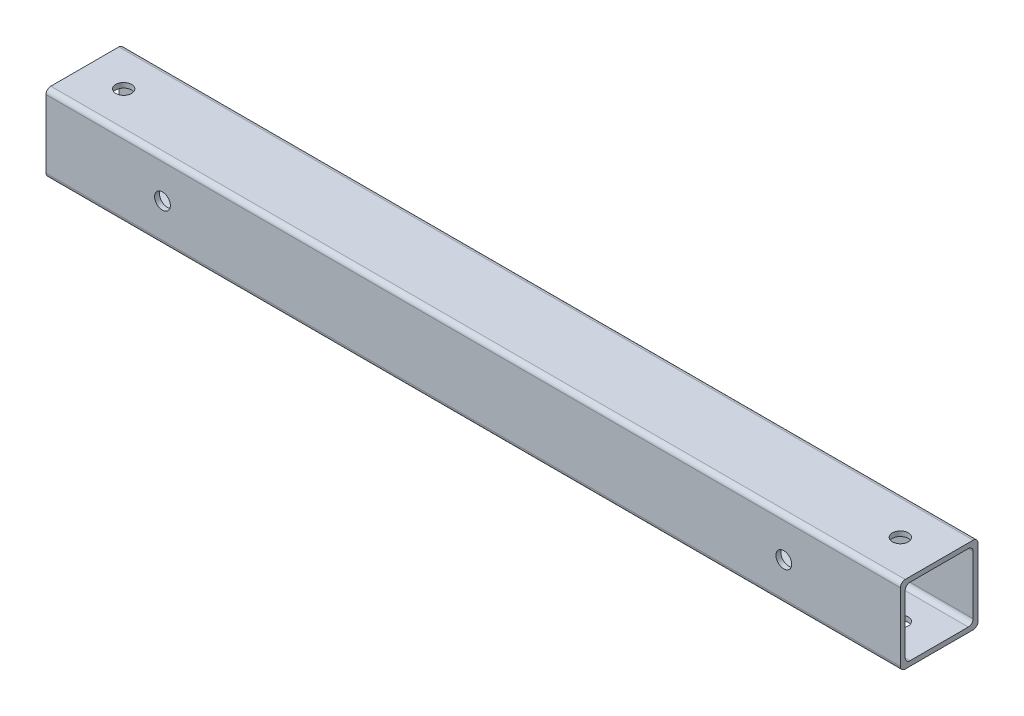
ISO-10303-21;
HEADER;
FILE_DESCRIPTION(('STEP AP214'),'2;1');
FILE_NAME('part.step','',(''),(''),'','','');
FILE_SCHEMA(('AUTOMOTIVE_DESIGN { 1 0 10303 214 1 1 1 1 }'));
ENDSEC;
DATA;
#1=APPLICATION_CONTEXT('core data for automotive mechanical design processes');
#2=APPLICATION_PROTOCOL_DEFINITION('international standard','automotive_design',2000,#1);
#3=PRODUCT_CONTEXT('',#1,'mechanical');
#4=PRODUCT('Part','Part','',(#3));
#5=PRODUCT_RELATED_PRODUCT_CATEGORY('part','',(#4));
#6=PRODUCT_DEFINITION_FORMATION('','',#4);
#7=PRODUCT_DEFINITION_CONTEXT('part definition',#1,'design');
#8=PRODUCT_DEFINITION('design','',#6,#7);
#9=PRODUCT_DEFINITION_SHAPE('','',#8);
#10=(LENGTH_UNIT() NAMED_UNIT(*) SI_UNIT(.MILLI.,.METRE.));
#11=(NAMED_UNIT(*) PLANE_ANGLE_UNIT() SI_UNIT($,.RADIAN.));
#12=(NAMED_UNIT(*) SI_UNIT($,.STERADIAN.) SOLID_ANGLE_UNIT());
#13=UNCERTAINTY_MEASURE_WITH_UNIT(LENGTH_MEASURE(1.E-05),#10,'distance_accuracy_value','');
#14=(GEOMETRIC_REPRESENTATION_CONTEXT(3) GLOBAL_UNCERTAINTY_ASSIGNED_CONTEXT((#13)) GLOBAL_UNIT_ASSIGNED_CONTEXT((#10,
#11,#12)) REPRESENTATION_CONTEXT('',''));
#15=CARTESIAN_POINT('',(0.,0.,0.));
#16=DIRECTION('',(0.,0.,1.));
#17=DIRECTION('',(1.,0.,0.));
#18=AXIS2_PLACEMENT_3D('',#15,#16,#17);
#19=CARTESIAN_POINT('',(0.,101.6,0.));
#20=DIRECTION('',(0.,0.,1.));
#21=DIRECTION('',(1.,0.,0.));
#22=AXIS2_PLACEMENT_3D('',#19,#20,#21);
#23=PLANE('',#22);
#24=DIRECTION('',(0.,-1.,0.));
#25=VECTOR('',#24,1.);
#26=CARTESIAN_POINT('',(-1117.6,101.6,1.36862006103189E-13));
#27=LINE('',#26,#25);
#28=CARTESIAN_POINT('',(-1117.6,95.25,1.36862006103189E-13));
#29=VERTEX_POINT('',#28);
#30=CARTESIAN_POINT('',(-1117.6,6.34999999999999,1.36862006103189E-13));
#31=VERTEX_POINT('',#30);
#32=EDGE_CURVE('E264',#29,#31,#27,.T.);
#33=ORIENTED_EDGE('',*,*,#32,.F.);
#34=DIRECTION('',(-1.,0.,0.));
#35=VECTOR('',#34,1.);
#36=CARTESIAN_POINT('',(0.,95.25,0.));
#37=LINE('',#36,#35);
#38=CARTESIAN_POINT('',(0.,95.25,0.));
#39=VERTEX_POINT('',#38);
#40=EDGE_CURVE('E313',#29,#39,#37,.F.);
#41=ORIENTED_EDGE('',*,*,#40,.T.);
#42=DIRECTION('',(0.,-1.,0.));
#43=VECTOR('',#42,1.);
#44=CARTESIAN_POINT('',(0.,101.6,0.));
#45=LINE('',#44,#43);
#46=CARTESIAN_POINT('',(0.,6.34999999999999,0.));
#47=VERTEX_POINT('',#46);
#48=EDGE_CURVE('E160',#39,#47,#45,.T.);
#49=ORIENTED_EDGE('',*,*,#48,.T.);
#50=DIRECTION('',(-1.,0.,0.));
#51=VECTOR('',#50,1.);
#52=CARTESIAN_POINT('',(-1117.6,6.34999999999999,1.36862006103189E-13));
#53=LINE('',#52,#51);
#54=EDGE_CURVE('E311',#47,#31,#53,.T.);
#55=ORIENTED_EDGE('',*,*,#54,.T.);
#56=EDGE_LOOP('',(#33,#41,#49,#55));
#57=FACE_BOUND('',#56,.T.);
#58=CARTESIAN_POINT('',(-965.2,50.8,0.));
#59=DIRECTION('',(0.,0.,1.));
#60=DIRECTION('',(1.,0.,0.));
#61=AXIS2_PLACEMENT_3D('',#58,#59,#60);
#62=CIRCLE('',#61,10.31875);
#63=CARTESIAN_POINT('',(-954.88125,50.8,0.));
#64=VERTEX_POINT('',#63);
#65=EDGE_CURVE('E195',#64,#64,#62,.T.);
#66=ORIENTED_EDGE('',*,*,#65,.T.);
#67=EDGE_LOOP('',(#66));
#68=FACE_BOUND('',#67,.T.);
#69=CARTESIAN_POINT('',(-152.4,50.8,0.));
#70=DIRECTION('',(0.,0.,-1.));
#71=DIRECTION('',(-1.,0.,0.));
#72=AXIS2_PLACEMENT_3D('',#69,#70,#71);
#73=CIRCLE('',#72,10.31875);
#74=CARTESIAN_POINT('',(-162.71875,50.8,0.));
#75=VERTEX_POINT('',#74);
#76=EDGE_CURVE('E415',#75,#75,#73,.T.);
#77=ORIENTED_EDGE('',*,*,#76,.F.);
#78=EDGE_LOOP('',(#77));
#79=FACE_BOUND('',#78,.T.);
#80=ADVANCED_FACE('F31',(#57,#68,#79),#23,.F.);
#81=CARTESIAN_POINT('',(0.,101.6,101.6));
#82=DIRECTION('',(0.,0.,-1.));
#83=DIRECTION('',(-1.,0.,0.));
#84=AXIS2_PLACEMENT_3D('',#81,#82,#83);
#85=PLANE('',#84);
#86=DIRECTION('',(0.,-1.,0.));
#87=VECTOR('',#86,1.);
#88=CARTESIAN_POINT('',(-1117.6,101.6,101.6));
#89=LINE('',#88,#87);
#90=CARTESIAN_POINT('',(-1117.6,95.25,101.6));
#91=VERTEX_POINT('',#90);
#92=CARTESIAN_POINT('',(-1117.6,6.34999999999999,101.6));
#93=VERTEX_POINT('',#92);
#94=EDGE_CURVE('E261',#91,#93,#89,.T.);
#95=ORIENTED_EDGE('',*,*,#94,.T.);
#96=DIRECTION('',(1.,0.,0.));
#97=VECTOR('',#96,1.);
#98=CARTESIAN_POINT('',(0.,6.34999999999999,101.6));
#99=LINE('',#98,#97);
#100=CARTESIAN_POINT('',(0.,6.34999999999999,101.6));
#101=VERTEX_POINT('',#100);
#102=EDGE_CURVE('E276',#93,#101,#99,.T.);
#103=ORIENTED_EDGE('',*,*,#102,.T.);
#104=DIRECTION('',(0.,-1.,0.));
#105=VECTOR('',#104,1.);
#106=CARTESIAN_POINT('',(0.,101.6,101.6));
#107=LINE('',#106,#105);
#108=CARTESIAN_POINT('',(0.,95.25,101.6));
#109=VERTEX_POINT('',#108);
#110=EDGE_CURVE('E254',#109,#101,#107,.T.);
#111=ORIENTED_EDGE('',*,*,#110,.F.);
#112=DIRECTION('',(1.,0.,0.));
#113=VECTOR('',#112,1.);
#114=CARTESIAN_POINT('',(0.,95.25,101.6));
#115=LINE('',#114,#113);
#116=EDGE_CURVE('E274',#109,#91,#115,.F.);
#117=ORIENTED_EDGE('',*,*,#116,.T.);
#118=EDGE_LOOP('',(#95,#103,#111,#117));
#119=FACE_BOUND('',#118,.T.);
#120=CARTESIAN_POINT('',(-965.2,50.8,101.6));
#121=DIRECTION('',(0.,0.,1.));
#122=DIRECTION('',(1.,0.,0.));
#123=AXIS2_PLACEMENT_3D('',#120,#121,#122);
#124=CIRCLE('',#123,10.31875);
#125=CARTESIAN_POINT('',(-954.88125,50.8,101.6));
#126=VERTEX_POINT('',#125);
#127=EDGE_CURVE('E203',#126,#126,#124,.T.);
#128=ORIENTED_EDGE('',*,*,#127,.F.);
#129=EDGE_LOOP('',(#128));
#130=FACE_BOUND('',#129,.T.);
#131=CARTESIAN_POINT('',(-152.4,50.8,101.6));
#132=DIRECTION('',(0.,0.,-1.));
#133=DIRECTION('',(-1.,0.,0.));
#134=AXIS2_PLACEMENT_3D('',#131,#132,#133);
#135=CIRCLE('',#134,10.31875);
#136=CARTESIAN_POINT('',(-162.71875,50.8,101.6));
#137=VERTEX_POINT('',#136);
#138=EDGE_CURVE('E422',#137,#137,#135,.T.);
#139=ORIENTED_EDGE('',*,*,#138,.T.);
#140=EDGE_LOOP('',(#139));
#141=FACE_BOUND('',#140,.T.);
#142=ADVANCED_FACE('F339',(#119,#130,#141),#85,.F.);
#143=CARTESIAN_POINT('',(0.000999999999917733,95.25,6.35000000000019));
#144=DIRECTION('',(0.,0.,-1.));
#145=DIRECTION('',(0.,1.,0.));
#146=AXIS2_PLACEMENT_3D('',#143,#144,#145);
#147=PLANE('',#146);
#148=DIRECTION('',(0.,1.,0.));
#149=VECTOR('',#148,1.);
#150=CARTESIAN_POINT('',(0.,95.25,6.35000000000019));
#151=LINE('',#150,#149);
#152=CARTESIAN_POINT('',(0.,12.7,6.3500000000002));
#153=VERTEX_POINT('',#152);
#154=CARTESIAN_POINT('',(0.,88.9,6.35000000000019));
#155=VERTEX_POINT('',#154);
#156=EDGE_CURVE('E230',#153,#155,#151,.T.);
#157=ORIENTED_EDGE('',*,*,#156,.T.);
#158=DIRECTION('',(-1.,0.,0.));
#159=VECTOR('',#158,1.);
#160=CARTESIAN_POINT('',(-1117.6,88.9,6.35000000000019));
#161=LINE('',#160,#159);
#162=CARTESIAN_POINT('',(-1117.6,88.9,6.35000000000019));
#163=VERTEX_POINT('',#162);
#164=EDGE_CURVE('E308',#155,#163,#161,.T.);
#165=ORIENTED_EDGE('',*,*,#164,.T.);
#166=DIRECTION('',(0.,-1.,0.));
#167=VECTOR('',#166,1.);
#168=CARTESIAN_POINT('',(-1117.6,95.25,6.35000000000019));
#169=LINE('',#168,#167);
#170=CARTESIAN_POINT('',(-1117.6,12.7,6.3500000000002));
#171=VERTEX_POINT('',#170);
#172=EDGE_CURVE('E233',#163,#171,#169,.T.);
#173=ORIENTED_EDGE('',*,*,#172,.T.);
#174=DIRECTION('',(-1.,0.,0.));
#175=VECTOR('',#174,1.);
#176=CARTESIAN_POINT('',(0.,12.7,6.3500000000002));
#177=LINE('',#176,#175);
#178=EDGE_CURVE('E306',#171,#153,#177,.F.);
#179=ORIENTED_EDGE('',*,*,#178,.T.);
#180=EDGE_LOOP('',(#157,#165,#173,#179));
#181=FACE_BOUND('',#180,.T.);
#182=CARTESIAN_POINT('',(-965.2,50.8,6.3500000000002));
#183=DIRECTION('',(0.,0.,-1.));
#184=DIRECTION('',(0.,1.,0.));
#185=AXIS2_PLACEMENT_3D('',#182,#183,#184);
#186=CIRCLE('',#185,10.31875);
#187=CARTESIAN_POINT('',(-965.2,61.11875,6.3500000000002));
#188=VERTEX_POINT('',#187);
#189=EDGE_CURVE('E194',#188,#188,#186,.T.);
#190=ORIENTED_EDGE('',*,*,#189,.T.);
#191=EDGE_LOOP('',(#190));
#192=FACE_BOUND('',#191,.T.);
#193=CARTESIAN_POINT('',(-152.4,50.8,6.3500000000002));
#194=DIRECTION('',(0.,0.,-1.));
#195=DIRECTION('',(0.,1.,0.));
#196=AXIS2_PLACEMENT_3D('',#193,#194,#195);
#197=CIRCLE('',#196,10.31875);
#198=CARTESIAN_POINT('',(-152.4,61.11875,6.3500000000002));
#199=VERTEX_POINT('',#198);
#200=EDGE_CURVE('E211',#199,#199,#197,.F.);
#201=ORIENTED_EDGE('',*,*,#200,.F.);
#202=EDGE_LOOP('',(#201));
#203=FACE_BOUND('',#202,.T.);
#204=ADVANCED_FACE('F345',(#181,#192,#203),#147,.F.);
#205=CARTESIAN_POINT('',(0.000999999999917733,95.25,95.2500000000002));
#206=DIRECTION('',(0.,0.,1.));
#207=DIRECTION('',(0.,-1.,0.));
#208=AXIS2_PLACEMENT_3D('',#205,#206,#207);
#209=PLANE('',#208);
#210=DIRECTION('',(0.,-1.,0.));
#211=VECTOR('',#210,1.);
#212=CARTESIAN_POINT('',(0.,95.25,95.2500000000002));
#213=LINE('',#212,#211);
#214=CARTESIAN_POINT('',(0.,88.9,95.2500000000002));
#215=VERTEX_POINT('',#214);
#216=CARTESIAN_POINT('',(0.,12.7,95.2500000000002));
#217=VERTEX_POINT('',#216);
#218=EDGE_CURVE('E153',#215,#217,#213,.T.);
#219=ORIENTED_EDGE('',*,*,#218,.T.);
#220=DIRECTION('',(-1.,0.,0.));
#221=VECTOR('',#220,1.);
#222=CARTESIAN_POINT('',(-1117.6,12.7,95.2500000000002));
#223=LINE('',#222,#221);
#224=CARTESIAN_POINT('',(-1117.6,12.7,95.2500000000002));
#225=VERTEX_POINT('',#224);
#226=EDGE_CURVE('E159',#217,#225,#223,.T.);
#227=ORIENTED_EDGE('',*,*,#226,.T.);
#228=DIRECTION('',(0.,1.,0.));
#229=VECTOR('',#228,1.);
#230=CARTESIAN_POINT('',(-1117.6,95.25,95.2500000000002));
#231=LINE('',#230,#229);
#232=CARTESIAN_POINT('',(-1117.6,88.9,95.2500000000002));
#233=VERTEX_POINT('',#232);
#234=EDGE_CURVE('E156',#225,#233,#231,.T.);
#235=ORIENTED_EDGE('',*,*,#234,.T.);
#236=DIRECTION('',(-1.,0.,0.));
#237=VECTOR('',#236,1.);
#238=CARTESIAN_POINT('',(0.,88.9,95.2500000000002));
#239=LINE('',#238,#237);
#240=EDGE_CURVE('E148',#233,#215,#239,.F.);
#241=ORIENTED_EDGE('',*,*,#240,.T.);
#242=EDGE_LOOP('',(#219,#227,#235,#241));
#243=FACE_BOUND('',#242,.T.);
#244=CARTESIAN_POINT('',(-965.2,50.8,95.2500000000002));
#245=DIRECTION('',(0.,0.,1.));
#246=DIRECTION('',(0.,-1.,0.));
#247=AXIS2_PLACEMENT_3D('',#244,#245,#246);
#248=CIRCLE('',#247,10.31875);
#249=CARTESIAN_POINT('',(-965.2,40.48125,95.2500000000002));
#250=VERTEX_POINT('',#249);
#251=EDGE_CURVE('E192',#250,#250,#248,.T.);
#252=ORIENTED_EDGE('',*,*,#251,.T.);
#253=EDGE_LOOP('',(#252));
#254=FACE_BOUND('',#253,.T.);
#255=CARTESIAN_POINT('',(-152.4,50.8,95.2500000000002));
#256=DIRECTION('',(0.,0.,1.));
#257=DIRECTION('',(0.,-1.,0.));
#258=AXIS2_PLACEMENT_3D('',#255,#256,#257);
#259=CIRCLE('',#258,10.31875);
#260=CARTESIAN_POINT('',(-152.4,40.48125,95.2500000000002));
#261=VERTEX_POINT('',#260);
#262=EDGE_CURVE('E35',#261,#261,#259,.F.);
#263=ORIENTED_EDGE('',*,*,#262,.F.);
#264=EDGE_LOOP('',(#263));
#265=FACE_BOUND('',#264,.T.);
#266=ADVANCED_FACE('F150',(#243,#254,#265),#209,.F.);
#267=CARTESIAN_POINT('',(0.,101.6,0.));
#268=DIRECTION('',(0.,-1.,0.));
#269=DIRECTION('',(0.,0.,-1.));
#270=AXIS2_PLACEMENT_3D('',#267,#268,#269);
#271=PLANE('',#270);
#272=DIRECTION('',(0.,0.,1.));
#273=VECTOR('',#272,1.);
#274=CARTESIAN_POINT('',(-1117.6,101.6,1.36862006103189E-13));
#275=LINE('',#274,#273);
#276=CARTESIAN_POINT('',(-1117.6,101.6,6.35000000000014));
#277=VERTEX_POINT('',#276);
#278=CARTESIAN_POINT('',(-1117.6,101.6,95.2500000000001));
#279=VERTEX_POINT('',#278);
#280=EDGE_CURVE('E250',#277,#279,#275,.T.);
#281=ORIENTED_EDGE('',*,*,#280,.T.);
#282=DIRECTION('',(1.,0.,0.));
#283=VECTOR('',#282,1.);
#284=CARTESIAN_POINT('',(0.,101.6,95.25));
#285=LINE('',#284,#283);
#286=CARTESIAN_POINT('',(0.,101.6,95.25));
#287=VERTEX_POINT('',#286);
#288=EDGE_CURVE('E300',#279,#287,#285,.T.);
#289=ORIENTED_EDGE('',*,*,#288,.T.);
#290=DIRECTION('',(0.,0.,-1.));
#291=VECTOR('',#290,1.);
#292=CARTESIAN_POINT('',(0.,101.6,0.));
#293=LINE('',#292,#291);
#294=CARTESIAN_POINT('',(0.,101.6,6.35));
#295=VERTEX_POINT('',#294);
#296=EDGE_CURVE('E247',#287,#295,#293,.T.);
#297=ORIENTED_EDGE('',*,*,#296,.T.);
#298=DIRECTION('',(-1.,0.,0.));
#299=VECTOR('',#298,1.);
#300=CARTESIAN_POINT('',(0.,101.6,6.35));
#301=LINE('',#300,#299);
#302=EDGE_CURVE('E297',#295,#277,#301,.T.);
#303=ORIENTED_EDGE('',*,*,#302,.T.);
#304=EDGE_LOOP('',(#281,#289,#297,#303));
#305=FACE_BOUND('',#304,.T.);
#306=CARTESIAN_POINT('',(-1066.8,101.6,50.8000000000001));
#307=DIRECTION('',(0.,1.,0.));
#308=DIRECTION('',(0.,0.,1.));
#309=AXIS2_PLACEMENT_3D('',#306,#307,#308);
#310=CIRCLE('',#309,10.31875);
#311=CARTESIAN_POINT('',(-1066.8,101.6,61.1187500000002));
#312=VERTEX_POINT('',#311);
#313=EDGE_CURVE('E222',#312,#312,#310,.T.);
#314=ORIENTED_EDGE('',*,*,#313,.F.);
#315=EDGE_LOOP('',(#314));
#316=FACE_BOUND('',#315,.T.);
#317=CARTESIAN_POINT('',(-50.8000000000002,101.6,50.8000000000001));
#318=DIRECTION('',(0.,-1.,0.));
#319=DIRECTION('',(0.,0.,1.));
#320=AXIS2_PLACEMENT_3D('',#317,#318,#319);
#321=CIRCLE('',#320,10.31875);
#322=CARTESIAN_POINT('',(-50.8000000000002,101.6,61.1187500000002));
#323=VERTEX_POINT('',#322);
#324=EDGE_CURVE('E206',#323,#323,#321,.T.);
#325=ORIENTED_EDGE('',*,*,#324,.T.);
#326=EDGE_LOOP('',(#325));
#327=FACE_BOUND('',#326,.T.);
#328=ADVANCED_FACE('F366',(#305,#316,#327),#271,.F.);
#329=CARTESIAN_POINT('',(0.,0.,0.));
#330=DIRECTION('',(0.,-1.,0.));
#331=DIRECTION('',(0.,0.,-1.));
#332=AXIS2_PLACEMENT_3D('',#329,#330,#331);
#333=PLANE('',#332);
#334=DIRECTION('',(0.,0.,-1.));
#335=VECTOR('',#334,1.);
#336=CARTESIAN_POINT('',(0.,0.,0.));
#337=LINE('',#336,#335);
#338=CARTESIAN_POINT('',(0.,0.,95.25));
#339=VERTEX_POINT('',#338);
#340=CARTESIAN_POINT('',(0.,0.,6.35));
#341=VERTEX_POINT('',#340);
#342=EDGE_CURVE('E246',#339,#341,#337,.T.);
#343=ORIENTED_EDGE('',*,*,#342,.F.);
#344=DIRECTION('',(1.,0.,0.));
#345=VECTOR('',#344,1.);
#346=CARTESIAN_POINT('',(-1117.6,0.,95.2500000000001));
#347=LINE('',#346,#345);
#348=CARTESIAN_POINT('',(-1117.6,0.,95.2500000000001));
#349=VERTEX_POINT('',#348);
#350=EDGE_CURVE('E289',#339,#349,#347,.F.);
#351=ORIENTED_EDGE('',*,*,#350,.T.);
#352=DIRECTION('',(0.,0.,1.));
#353=VECTOR('',#352,1.);
#354=CARTESIAN_POINT('',(-1117.6,0.,1.36862006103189E-13));
#355=LINE('',#354,#353);
#356=CARTESIAN_POINT('',(-1117.6,0.,6.35000000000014));
#357=VERTEX_POINT('',#356);
#358=EDGE_CURVE('E251',#357,#349,#355,.T.);
#359=ORIENTED_EDGE('',*,*,#358,.F.);
#360=DIRECTION('',(-1.,0.,0.));
#361=VECTOR('',#360,1.);
#362=CARTESIAN_POINT('',(0.,0.,6.35));
#363=LINE('',#362,#361);
#364=EDGE_CURVE('E287',#357,#341,#363,.F.);
#365=ORIENTED_EDGE('',*,*,#364,.T.);
#366=EDGE_LOOP('',(#343,#351,#359,#365));
#367=FACE_BOUND('',#366,.T.);
#368=CARTESIAN_POINT('',(-1066.8,0.,50.8000000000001));
#369=DIRECTION('',(0.,1.,0.));
#370=DIRECTION('',(0.,0.,1.));
#371=AXIS2_PLACEMENT_3D('',#368,#369,#370);
#372=CIRCLE('',#371,10.31875);
#373=CARTESIAN_POINT('',(-1066.8,0.,61.1187500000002));
#374=VERTEX_POINT('',#373);
#375=EDGE_CURVE('E191',#374,#374,#372,.T.);
#376=ORIENTED_EDGE('',*,*,#375,.T.);
#377=EDGE_LOOP('',(#376));
#378=FACE_BOUND('',#377,.T.);
#379=CARTESIAN_POINT('',(-50.8000000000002,0.,50.8000000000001));
#380=DIRECTION('',(0.,-1.,0.));
#381=DIRECTION('',(0.,0.,1.));
#382=AXIS2_PLACEMENT_3D('',#379,#380,#381);
#383=CIRCLE('',#382,10.31875);
#384=CARTESIAN_POINT('',(-50.8000000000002,0.,61.1187500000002));
#385=VERTEX_POINT('',#384);
#386=EDGE_CURVE('E199',#385,#385,#383,.T.);
#387=ORIENTED_EDGE('',*,*,#386,.F.);
#388=EDGE_LOOP('',(#387));
#389=FACE_BOUND('',#388,.T.);
#390=ADVANCED_FACE('F358',(#367,#378,#389),#333,.T.);
#391=CARTESIAN_POINT('',(0.000999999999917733,95.25,6.35000000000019));
#392=DIRECTION('',(0.,1.,0.));
#393=DIRECTION('',(0.,0.,1.));
#394=AXIS2_PLACEMENT_3D('',#391,#392,#393);
#395=PLANE('',#394);
#396=DIRECTION('',(0.,0.,1.));
#397=VECTOR('',#396,1.);
#398=CARTESIAN_POINT('',(0.,95.25,6.35000000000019));
#399=LINE('',#398,#397);
#400=CARTESIAN_POINT('',(0.,95.25,12.7000000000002));
#401=VERTEX_POINT('',#400);
#402=CARTESIAN_POINT('',(0.,95.25,88.9000000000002));
#403=VERTEX_POINT('',#402);
#404=EDGE_CURVE('E171',#401,#403,#399,.T.);
#405=ORIENTED_EDGE('',*,*,#404,.T.);
#406=DIRECTION('',(-1.,0.,0.));
#407=VECTOR('',#406,1.);
#408=CARTESIAN_POINT('',(-1117.6,95.25,88.9000000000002));
#409=LINE('',#408,#407);
#410=CARTESIAN_POINT('',(-1117.6,95.25,88.9000000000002));
#411=VERTEX_POINT('',#410);
#412=EDGE_CURVE('E177',#403,#411,#409,.T.);
#413=ORIENTED_EDGE('',*,*,#412,.T.);
#414=DIRECTION('',(0.,0.,-1.));
#415=VECTOR('',#414,1.);
#416=CARTESIAN_POINT('',(-1117.6,95.25,6.35000000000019));
#417=LINE('',#416,#415);
#418=CARTESIAN_POINT('',(-1117.6,95.25,12.7000000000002));
#419=VERTEX_POINT('',#418);
#420=EDGE_CURVE('E240',#411,#419,#417,.T.);
#421=ORIENTED_EDGE('',*,*,#420,.T.);
#422=DIRECTION('',(-1.,0.,0.));
#423=VECTOR('',#422,1.);
#424=CARTESIAN_POINT('',(0.,95.25,12.7000000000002));
#425=LINE('',#424,#423);
#426=EDGE_CURVE('E303',#419,#401,#425,.F.);
#427=ORIENTED_EDGE('',*,*,#426,.T.);
#428=EDGE_LOOP('',(#405,#413,#421,#427));
#429=FACE_BOUND('',#428,.T.);
#430=CARTESIAN_POINT('',(-1066.8,95.25,50.8000000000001));
#431=DIRECTION('',(0.,1.,0.));
#432=DIRECTION('',(0.,0.,1.));
#433=AXIS2_PLACEMENT_3D('',#430,#431,#432);
#434=CIRCLE('',#433,10.31875);
#435=CARTESIAN_POINT('',(-1066.8,95.25,61.1187500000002));
#436=VERTEX_POINT('',#435);
#437=EDGE_CURVE('E172',#436,#436,#434,.T.);
#438=ORIENTED_EDGE('',*,*,#437,.T.);
#439=EDGE_LOOP('',(#438));
#440=FACE_BOUND('',#439,.T.);
#441=CARTESIAN_POINT('',(-50.8000000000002,95.25,50.8000000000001));
#442=DIRECTION('',(0.,1.,0.));
#443=DIRECTION('',(0.,0.,1.));
#444=AXIS2_PLACEMENT_3D('',#441,#442,#443);
#445=CIRCLE('',#444,10.31875);
#446=CARTESIAN_POINT('',(-50.8000000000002,95.25,61.1187500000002));
#447=VERTEX_POINT('',#446);
#448=EDGE_CURVE('E198',#447,#447,#445,.F.);
#449=ORIENTED_EDGE('',*,*,#448,.F.);
#450=EDGE_LOOP('',(#449));
#451=FACE_BOUND('',#450,.T.);
#452=ADVANCED_FACE('F353',(#429,#440,#451),#395,.F.);
#453=CARTESIAN_POINT('',(0.000999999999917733,6.35,6.35000000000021));
#454=DIRECTION('',(0.,-1.,0.));
#455=DIRECTION('',(0.,0.,-1.));
#456=AXIS2_PLACEMENT_3D('',#453,#454,#455);
#457=PLANE('',#456);
#458=DIRECTION('',(0.,0.,1.));
#459=VECTOR('',#458,1.);
#460=CARTESIAN_POINT('',(-1117.6,6.35,6.35000000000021));
#461=LINE('',#460,#459);
#462=CARTESIAN_POINT('',(-1117.6,6.35,12.7000000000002));
#463=VERTEX_POINT('',#462);
#464=CARTESIAN_POINT('',(-1117.6,6.35,88.9000000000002));
#465=VERTEX_POINT('',#464);
#466=EDGE_CURVE('E236',#463,#465,#461,.T.);
#467=ORIENTED_EDGE('',*,*,#466,.T.);
#468=DIRECTION('',(-1.,0.,0.));
#469=VECTOR('',#468,1.);
#470=CARTESIAN_POINT('',(0.,6.35,88.9000000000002));
#471=LINE('',#470,#469);
#472=CARTESIAN_POINT('',(0.,6.35,88.9000000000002));
#473=VERTEX_POINT('',#472);
#474=EDGE_CURVE('E272',#465,#473,#471,.F.);
#475=ORIENTED_EDGE('',*,*,#474,.T.);
#476=DIRECTION('',(0.,0.,-1.));
#477=VECTOR('',#476,1.);
#478=CARTESIAN_POINT('',(0.,6.35,6.35000000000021));
#479=LINE('',#478,#477);
#480=CARTESIAN_POINT('',(0.,6.35,12.7000000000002));
#481=VERTEX_POINT('',#480);
#482=EDGE_CURVE('E243',#473,#481,#479,.T.);
#483=ORIENTED_EDGE('',*,*,#482,.T.);
#484=DIRECTION('',(-1.,0.,0.));
#485=VECTOR('',#484,1.);
#486=CARTESIAN_POINT('',(-1117.6,6.35,12.7000000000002));
#487=LINE('',#486,#485);
#488=EDGE_CURVE('E269',#481,#463,#487,.T.);
#489=ORIENTED_EDGE('',*,*,#488,.T.);
#490=EDGE_LOOP('',(#467,#475,#483,#489));
#491=FACE_BOUND('',#490,.T.);
#492=CARTESIAN_POINT('',(-1066.8,6.35,50.8000000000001));
#493=DIRECTION('',(0.,-1.,0.));
#494=DIRECTION('',(0.,0.,-1.));
#495=AXIS2_PLACEMENT_3D('',#492,#493,#494);
#496=CIRCLE('',#495,10.31875);
#497=CARTESIAN_POINT('',(-1066.8,6.35,40.4812500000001));
#498=VERTEX_POINT('',#497);
#499=EDGE_CURVE('E188',#498,#498,#496,.T.);
#500=ORIENTED_EDGE('',*,*,#499,.T.);
#501=EDGE_LOOP('',(#500));
#502=FACE_BOUND('',#501,.T.);
#503=CARTESIAN_POINT('',(-50.8000000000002,6.35,50.8000000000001));
#504=DIRECTION('',(0.,-1.,0.));
#505=DIRECTION('',(0.,0.,-1.));
#506=AXIS2_PLACEMENT_3D('',#503,#504,#505);
#507=CIRCLE('',#506,10.31875);
#508=CARTESIAN_POINT('',(-50.8000000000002,6.35,40.4812500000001));
#509=VERTEX_POINT('',#508);
#510=EDGE_CURVE('E196',#509,#509,#507,.F.);
#511=ORIENTED_EDGE('',*,*,#510,.F.);
#512=EDGE_LOOP('',(#511));
#513=FACE_BOUND('',#512,.T.);
#514=ADVANCED_FACE('F322',(#491,#502,#513),#457,.F.);
#515=CARTESIAN_POINT('',(0.,101.6,0.));
#516=DIRECTION('',(-1.,0.,0.));
#517=DIRECTION('',(0.,0.,1.));
#518=AXIS2_PLACEMENT_3D('',#515,#516,#517);
#519=PLANE('',#518);
#520=ORIENTED_EDGE('',*,*,#404,.F.);
#521=CARTESIAN_POINT('',(0.,88.9,12.7000000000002));
#522=DIRECTION('',(-1.,0.,0.));
#523=DIRECTION('',(0.,0.,1.));
#524=AXIS2_PLACEMENT_3D('',#521,#522,#523);
#525=CIRCLE('',#524,6.35);
#526=EDGE_CURVE('E181',#401,#155,#525,.T.);
#527=ORIENTED_EDGE('',*,*,#526,.T.);
#528=ORIENTED_EDGE('',*,*,#156,.F.);
#529=CARTESIAN_POINT('',(0.,12.7,12.7000000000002));
#530=DIRECTION('',(-1.,0.,0.));
#531=DIRECTION('',(0.,0.,1.));
#532=AXIS2_PLACEMENT_3D('',#529,#530,#531);
#533=CIRCLE('',#532,6.35);
#534=EDGE_CURVE('E11',#153,#481,#533,.T.);
#535=ORIENTED_EDGE('',*,*,#534,.T.);
#536=ORIENTED_EDGE('',*,*,#482,.F.);
#537=CARTESIAN_POINT('',(0.,12.7,88.9000000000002));
#538=DIRECTION('',(-1.,0.,0.));
#539=DIRECTION('',(0.,0.,1.));
#540=AXIS2_PLACEMENT_3D('',#537,#538,#539);
#541=CIRCLE('',#540,6.35);
#542=EDGE_CURVE('E170',#473,#217,#541,.T.);
#543=ORIENTED_EDGE('',*,*,#542,.T.);
#544=ORIENTED_EDGE('',*,*,#218,.F.);
#545=CARTESIAN_POINT('',(0.,88.9,88.9000000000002));
#546=DIRECTION('',(-1.,0.,0.));
#547=DIRECTION('',(0.,0.,1.));
#548=AXIS2_PLACEMENT_3D('',#545,#546,#547);
#549=CIRCLE('',#548,6.35);
#550=EDGE_CURVE('E166',#215,#403,#549,.T.);
#551=ORIENTED_EDGE('',*,*,#550,.T.);
#552=EDGE_LOOP('',(#520,#527,#528,#535,#536,#543,#544,#551));
#553=FACE_BOUND('',#552,.T.);
#554=ORIENTED_EDGE('',*,*,#110,.T.);
#555=CARTESIAN_POINT('',(0.,6.34999999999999,95.25));
#556=DIRECTION('',(-1.,0.,0.));
#557=DIRECTION('',(0.,0.,1.));
#558=AXIS2_PLACEMENT_3D('',#555,#556,#557);
#559=CIRCLE('',#558,6.35);
#560=EDGE_CURVE('E285',#101,#339,#559,.F.);
#561=ORIENTED_EDGE('',*,*,#560,.T.);
#562=ORIENTED_EDGE('',*,*,#342,.T.);
#563=CARTESIAN_POINT('',(0.,6.34999999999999,6.35));
#564=DIRECTION('',(-1.,0.,0.));
#565=DIRECTION('',(0.,0.,1.));
#566=AXIS2_PLACEMENT_3D('',#563,#564,#565);
#567=CIRCLE('',#566,6.35);
#568=EDGE_CURVE('E279',#341,#47,#567,.F.);
#569=ORIENTED_EDGE('',*,*,#568,.T.);
#570=ORIENTED_EDGE('',*,*,#48,.F.);
#571=CARTESIAN_POINT('',(0.,95.25,6.35));
#572=DIRECTION('',(-1.,0.,0.));
#573=DIRECTION('',(0.,0.,1.));
#574=AXIS2_PLACEMENT_3D('',#571,#572,#573);
#575=CIRCLE('',#574,6.35);
#576=EDGE_CURVE('E281',#39,#295,#575,.F.);
#577=ORIENTED_EDGE('',*,*,#576,.T.);
#578=ORIENTED_EDGE('',*,*,#296,.F.);
#579=CARTESIAN_POINT('',(0.,95.25,95.25));
#580=DIRECTION('',(-1.,0.,0.));
#581=DIRECTION('',(0.,0.,1.));
#582=AXIS2_PLACEMENT_3D('',#579,#580,#581);
#583=CIRCLE('',#582,6.35);
#584=EDGE_CURVE('E283',#287,#109,#583,.F.);
#585=ORIENTED_EDGE('',*,*,#584,.T.);
#586=EDGE_LOOP('',(#554,#561,#562,#569,#570,#577,#578,#585));
#587=FACE_BOUND('',#586,.T.);
#588=ADVANCED_FACE('F164',(#553,#587),#519,.F.);
#589=CARTESIAN_POINT('',(-1117.6,101.6,1.36862006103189E-13));
#590=DIRECTION('',(1.,0.,0.));
#591=DIRECTION('',(0.,0.,-1.));
#592=AXIS2_PLACEMENT_3D('',#589,#590,#591);
#593=PLANE('',#592);
#594=ORIENTED_EDGE('',*,*,#466,.F.);
#595=CARTESIAN_POINT('',(-1117.6,12.7,12.7000000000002));
#596=DIRECTION('',(1.,0.,0.));
#597=DIRECTION('',(0.,0.,-1.));
#598=AXIS2_PLACEMENT_3D('',#595,#596,#597);
#599=CIRCLE('',#598,6.35);
#600=EDGE_CURVE('E40',#463,#171,#599,.T.);
#601=ORIENTED_EDGE('',*,*,#600,.T.);
#602=ORIENTED_EDGE('',*,*,#172,.F.);
#603=CARTESIAN_POINT('',(-1117.6,88.9,12.7000000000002));
#604=DIRECTION('',(1.,0.,0.));
#605=DIRECTION('',(0.,0.,-1.));
#606=AXIS2_PLACEMENT_3D('',#603,#604,#605);
#607=CIRCLE('',#606,6.35);
#608=EDGE_CURVE('E178',#163,#419,#607,.T.);
#609=ORIENTED_EDGE('',*,*,#608,.T.);
#610=ORIENTED_EDGE('',*,*,#420,.F.);
#611=CARTESIAN_POINT('',(-1117.6,88.9,88.9000000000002));
#612=DIRECTION('',(1.,0.,0.));
#613=DIRECTION('',(0.,0.,-1.));
#614=AXIS2_PLACEMENT_3D('',#611,#612,#613);
#615=CIRCLE('',#614,6.35);
#616=EDGE_CURVE('E179',#411,#233,#615,.T.);
#617=ORIENTED_EDGE('',*,*,#616,.T.);
#618=ORIENTED_EDGE('',*,*,#234,.F.);
#619=CARTESIAN_POINT('',(-1117.6,12.7,88.9000000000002));
#620=DIRECTION('',(1.,0.,0.));
#621=DIRECTION('',(0.,0.,-1.));
#622=AXIS2_PLACEMENT_3D('',#619,#620,#621);
#623=CIRCLE('',#622,6.35);
#624=EDGE_CURVE('E315',#225,#465,#623,.T.);
#625=ORIENTED_EDGE('',*,*,#624,.T.);
#626=EDGE_LOOP('',(#594,#601,#602,#609,#610,#617,#618,#625));
#627=FACE_BOUND('',#626,.T.);
#628=ORIENTED_EDGE('',*,*,#358,.T.);
#629=CARTESIAN_POINT('',(-1117.6,6.34999999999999,95.2500000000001));
#630=DIRECTION('',(1.,0.,0.));
#631=DIRECTION('',(0.,0.,-1.));
#632=AXIS2_PLACEMENT_3D('',#629,#630,#631);
#633=CIRCLE('',#632,6.35);
#634=EDGE_CURVE('E295',#349,#93,#633,.F.);
#635=ORIENTED_EDGE('',*,*,#634,.T.);
#636=ORIENTED_EDGE('',*,*,#94,.F.);
#637=CARTESIAN_POINT('',(-1117.6,95.25,95.2500000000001));
#638=DIRECTION('',(1.,0.,0.));
#639=DIRECTION('',(0.,0.,-1.));
#640=AXIS2_PLACEMENT_3D('',#637,#638,#639);
#641=CIRCLE('',#640,6.35);
#642=EDGE_CURVE('E293',#91,#279,#641,.F.);
#643=ORIENTED_EDGE('',*,*,#642,.T.);
#644=ORIENTED_EDGE('',*,*,#280,.F.);
#645=CARTESIAN_POINT('',(-1117.6,95.25,6.35000000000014));
#646=DIRECTION('',(1.,0.,0.));
#647=DIRECTION('',(0.,0.,-1.));
#648=AXIS2_PLACEMENT_3D('',#645,#646,#647);
#649=CIRCLE('',#648,6.35);
#650=EDGE_CURVE('E56',#277,#29,#649,.F.);
#651=ORIENTED_EDGE('',*,*,#650,.T.);
#652=ORIENTED_EDGE('',*,*,#32,.T.);
#653=CARTESIAN_POINT('',(-1117.6,6.34999999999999,6.35000000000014));
#654=DIRECTION('',(1.,0.,0.));
#655=DIRECTION('',(0.,0.,-1.));
#656=AXIS2_PLACEMENT_3D('',#653,#654,#655);
#657=CIRCLE('',#656,6.35);
#658=EDGE_CURVE('E48',#31,#357,#657,.F.);
#659=ORIENTED_EDGE('',*,*,#658,.T.);
#660=EDGE_LOOP('',(#628,#635,#636,#643,#644,#651,#652,#659));
#661=FACE_BOUND('',#660,.T.);
#662=ADVANCED_FACE('F318',(#627,#661),#593,.F.);
#663=CARTESIAN_POINT('',(0.000999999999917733,12.7,88.9000000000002));
#664=DIRECTION('',(1.,0.,0.));
#665=DIRECTION('',(0.,0.,-1.));
#666=AXIS2_PLACEMENT_3D('',#663,#664,#665);
#667=CYLINDRICAL_SURFACE('',#666,6.35);
#668=ORIENTED_EDGE('',*,*,#542,.F.);
#669=ORIENTED_EDGE('',*,*,#474,.F.);
#670=ORIENTED_EDGE('',*,*,#624,.F.);
#671=ORIENTED_EDGE('',*,*,#226,.F.);
#672=EDGE_LOOP('',(#668,#669,#670,#671));
#673=FACE_BOUND('',#672,.T.);
#674=ADVANCED_FACE('F325',(#673),#667,.F.);
#675=CARTESIAN_POINT('',(0.,6.34999999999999,95.25));
#676=DIRECTION('',(-1.,0.,0.));
#677=DIRECTION('',(0.,0.,1.));
#678=AXIS2_PLACEMENT_3D('',#675,#676,#677);
#679=CYLINDRICAL_SURFACE('',#678,6.35);
#680=ORIENTED_EDGE('',*,*,#634,.F.);
#681=ORIENTED_EDGE('',*,*,#350,.F.);
#682=ORIENTED_EDGE('',*,*,#560,.F.);
#683=ORIENTED_EDGE('',*,*,#102,.F.);
#684=EDGE_LOOP('',(#680,#681,#682,#683));
#685=FACE_BOUND('',#684,.T.);
#686=ADVANCED_FACE('F327',(#685),#679,.T.);
#687=CARTESIAN_POINT('',(0.,95.25,95.25));
#688=DIRECTION('',(1.,0.,0.));
#689=DIRECTION('',(0.,0.,-1.));
#690=AXIS2_PLACEMENT_3D('',#687,#688,#689);
#691=CYLINDRICAL_SURFACE('',#690,6.35);
#692=ORIENTED_EDGE('',*,*,#642,.F.);
#693=ORIENTED_EDGE('',*,*,#116,.F.);
#694=ORIENTED_EDGE('',*,*,#584,.F.);
#695=ORIENTED_EDGE('',*,*,#288,.F.);
#696=EDGE_LOOP('',(#692,#693,#694,#695));
#697=FACE_BOUND('',#696,.T.);
#698=ADVANCED_FACE('F333',(#697),#691,.T.);
#699=CARTESIAN_POINT('',(0.000999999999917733,88.9,88.9000000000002));
#700=DIRECTION('',(1.,0.,0.));
#701=DIRECTION('',(0.,0.,-1.));
#702=AXIS2_PLACEMENT_3D('',#699,#700,#701);
#703=CYLINDRICAL_SURFACE('',#702,6.35);
#704=ORIENTED_EDGE('',*,*,#550,.F.);
#705=ORIENTED_EDGE('',*,*,#240,.F.);
#706=ORIENTED_EDGE('',*,*,#616,.F.);
#707=ORIENTED_EDGE('',*,*,#412,.F.);
#708=EDGE_LOOP('',(#704,#705,#706,#707));
#709=FACE_BOUND('',#708,.T.);
#710=ADVANCED_FACE('F175',(#709),#703,.F.);
#711=CARTESIAN_POINT('',(0.000999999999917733,88.9,12.7000000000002));
#712=DIRECTION('',(1.,0.,0.));
#713=DIRECTION('',(0.,0.,-1.));
#714=AXIS2_PLACEMENT_3D('',#711,#712,#713);
#715=CYLINDRICAL_SURFACE('',#714,6.35);
#716=ORIENTED_EDGE('',*,*,#526,.F.);
#717=ORIENTED_EDGE('',*,*,#426,.F.);
#718=ORIENTED_EDGE('',*,*,#608,.F.);
#719=ORIENTED_EDGE('',*,*,#164,.F.);
#720=EDGE_LOOP('',(#716,#717,#718,#719));
#721=FACE_BOUND('',#720,.T.);
#722=ADVANCED_FACE('F538',(#721),#715,.F.);
#723=CARTESIAN_POINT('',(0.,95.25,6.35));
#724=DIRECTION('',(-1.,0.,0.));
#725=DIRECTION('',(0.,0.,1.));
#726=AXIS2_PLACEMENT_3D('',#723,#724,#725);
#727=CYLINDRICAL_SURFACE('',#726,6.35);
#728=ORIENTED_EDGE('',*,*,#576,.F.);
#729=ORIENTED_EDGE('',*,*,#40,.F.);
#730=ORIENTED_EDGE('',*,*,#650,.F.);
#731=ORIENTED_EDGE('',*,*,#302,.F.);
#732=EDGE_LOOP('',(#728,#729,#730,#731));
#733=FACE_BOUND('',#732,.T.);
#734=ADVANCED_FACE('F529',(#733),#727,.T.);
#735=CARTESIAN_POINT('',(0.000999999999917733,12.7,12.7000000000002));
#736=DIRECTION('',(1.,0.,0.));
#737=DIRECTION('',(0.,0.,-1.));
#738=AXIS2_PLACEMENT_3D('',#735,#736,#737);
#739=CYLINDRICAL_SURFACE('',#738,6.35);
#740=ORIENTED_EDGE('',*,*,#534,.F.);
#741=ORIENTED_EDGE('',*,*,#178,.F.);
#742=ORIENTED_EDGE('',*,*,#600,.F.);
#743=ORIENTED_EDGE('',*,*,#488,.F.);
#744=EDGE_LOOP('',(#740,#741,#742,#743));
#745=FACE_BOUND('',#744,.T.);
#746=ADVANCED_FACE('F393',(#745),#739,.F.);
#747=CARTESIAN_POINT('',(0.,6.34999999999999,6.35));
#748=DIRECTION('',(1.,0.,0.));
#749=DIRECTION('',(0.,0.,-1.));
#750=AXIS2_PLACEMENT_3D('',#747,#748,#749);
#751=CYLINDRICAL_SURFACE('',#750,6.35);
#752=ORIENTED_EDGE('',*,*,#568,.F.);
#753=ORIENTED_EDGE('',*,*,#364,.F.);
#754=ORIENTED_EDGE('',*,*,#658,.F.);
#755=ORIENTED_EDGE('',*,*,#54,.F.);
#756=EDGE_LOOP('',(#752,#753,#754,#755));
#757=FACE_BOUND('',#756,.T.);
#758=ADVANCED_FACE('F33',(#757),#751,.T.);
#759=CARTESIAN_POINT('',(-1066.8,0.,50.8000000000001));
#760=DIRECTION('',(0.,1.,0.));
#761=DIRECTION('',(0.,0.,1.));
#762=AXIS2_PLACEMENT_3D('',#759,#760,#761);
#763=CYLINDRICAL_SURFACE('',#762,10.31875);
#764=ORIENTED_EDGE('',*,*,#375,.F.);
#765=EDGE_LOOP('',(#764));
#766=FACE_BOUND('',#765,.T.);
#767=ORIENTED_EDGE('',*,*,#499,.F.);
#768=EDGE_LOOP('',(#767));
#769=FACE_BOUND('',#768,.T.);
#770=ADVANCED_FACE('F380',(#766,#769),#763,.F.);
#771=ORIENTED_EDGE('',*,*,#313,.T.);
#772=EDGE_LOOP('',(#771));
#773=FACE_BOUND('',#772,.T.);
#774=ORIENTED_EDGE('',*,*,#437,.F.);
#775=EDGE_LOOP('',(#774));
#776=FACE_BOUND('',#775,.T.);
#777=ADVANCED_FACE('F383',(#773,#776),#763,.F.);
#778=CARTESIAN_POINT('',(-965.2,50.8,0.));
#779=DIRECTION('',(0.,0.,1.));
#780=DIRECTION('',(1.,0.,0.));
#781=AXIS2_PLACEMENT_3D('',#778,#779,#780);
#782=CYLINDRICAL_SURFACE('',#781,10.31875);
#783=ORIENTED_EDGE('',*,*,#127,.T.);
#784=EDGE_LOOP('',(#783));
#785=FACE_BOUND('',#784,.T.);
#786=ORIENTED_EDGE('',*,*,#251,.F.);
#787=EDGE_LOOP('',(#786));
#788=FACE_BOUND('',#787,.T.);
#789=ADVANCED_FACE('F391',(#785,#788),#782,.F.);
#790=ORIENTED_EDGE('',*,*,#65,.F.);
#791=EDGE_LOOP('',(#790));
#792=FACE_BOUND('',#791,.T.);
#793=ORIENTED_EDGE('',*,*,#189,.F.);
#794=EDGE_LOOP('',(#793));
#795=FACE_BOUND('',#794,.T.);
#796=ADVANCED_FACE('F395',(#792,#795),#782,.F.);
#797=CARTESIAN_POINT('',(-50.8000000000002,0.,50.8000000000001));
#798=DIRECTION('',(0.,1.,0.));
#799=DIRECTION('',(0.,0.,1.));
#800=AXIS2_PLACEMENT_3D('',#797,#798,#799);
#801=CYLINDRICAL_SURFACE('',#800,10.31875);
#802=ORIENTED_EDGE('',*,*,#386,.T.);
#803=EDGE_LOOP('',(#802));
#804=FACE_BOUND('',#803,.T.);
#805=ORIENTED_EDGE('',*,*,#510,.T.);
#806=EDGE_LOOP('',(#805));
#807=FACE_BOUND('',#806,.T.);
#808=ADVANCED_FACE('F398',(#804,#807),#801,.F.);
#809=ORIENTED_EDGE('',*,*,#324,.F.);
#810=EDGE_LOOP('',(#809));
#811=FACE_BOUND('',#810,.T.);
#812=ORIENTED_EDGE('',*,*,#448,.T.);
#813=EDGE_LOOP('',(#812));
#814=FACE_BOUND('',#813,.T.);
#815=ADVANCED_FACE('F400',(#811,#814),#801,.F.);
#816=CARTESIAN_POINT('',(-152.4,50.8,0.));
#817=DIRECTION('',(0.,0.,1.));
#818=DIRECTION('',(1.,0.,0.));
#819=AXIS2_PLACEMENT_3D('',#816,#817,#818);
#820=CYLINDRICAL_SURFACE('',#819,10.31875);
#821=ORIENTED_EDGE('',*,*,#138,.F.);
#822=EDGE_LOOP('',(#821));
#823=FACE_BOUND('',#822,.T.);
#824=ORIENTED_EDGE('',*,*,#262,.T.);
#825=EDGE_LOOP('',(#824));
#826=FACE_BOUND('',#825,.T.);
#827=ADVANCED_FACE('F403',(#823,#826),#820,.F.);
#828=ORIENTED_EDGE('',*,*,#76,.T.);
#829=EDGE_LOOP('',(#828));
#830=FACE_BOUND('',#829,.T.);
#831=ORIENTED_EDGE('',*,*,#200,.T.);
#832=EDGE_LOOP('',(#831));
#833=FACE_BOUND('',#832,.T.);
#834=ADVANCED_FACE('F405',(#830,#833),#820,.F.);
#835=CLOSED_SHELL('',(#80,#142,#204,#266,#328,#390,#452,#514,#588,#662,#674,#686,#698,#710,#722,
#734,#746,#758,#770,#777,#789,#796,#808,#815,#827,#834));
#836=MANIFOLD_SOLID_BREP('B2',#835);
#837=ADVANCED_BREP_SHAPE_REPRESENTATION('',(#18,#836),#14);
#838=SHAPE_DEFINITION_REPRESENTATION(#9,#837);
ENDSEC;
END-ISO-10303-21;
